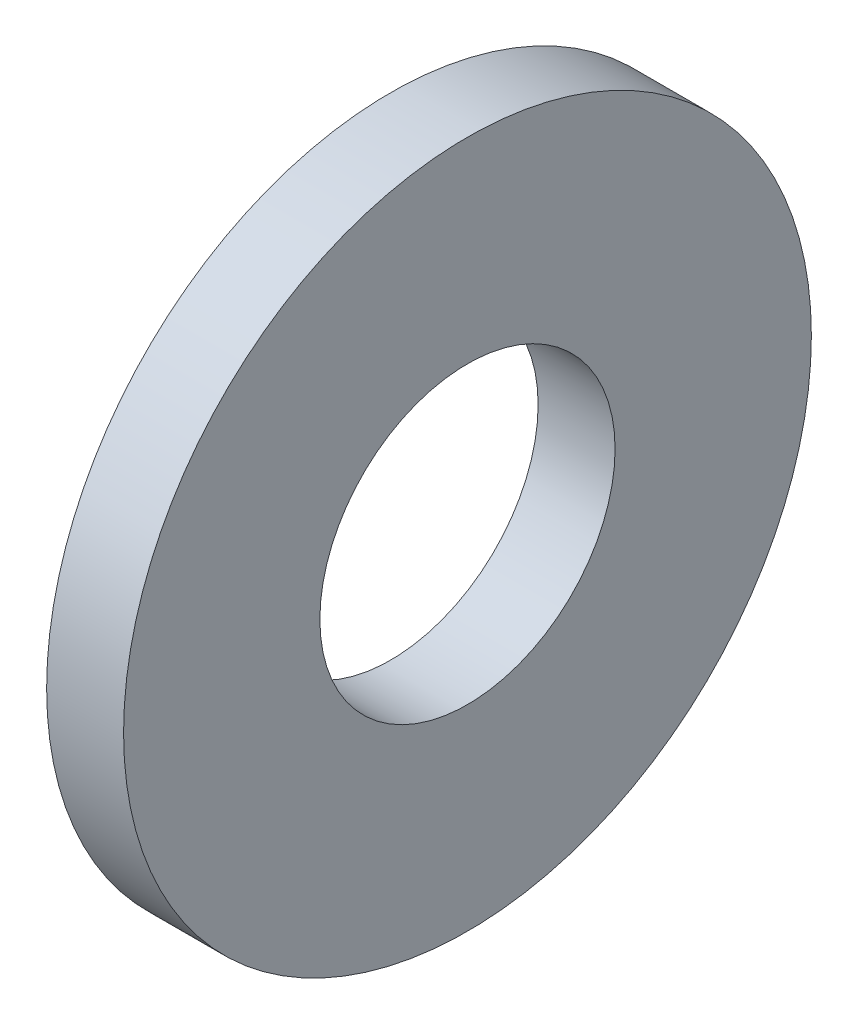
from build123d import *

# Parameters (mm, degrees)
SKETCH1_W = 1.2446
SKETCH1_H = 3.175


with BuildPart() as part:
    # Sketch1 → Base-Revolve (revolve)
    with BuildSketch(Plane.XY, mode=Mode.PRIVATE) as base_revolve_sk:
        with Locations((-0.6223, 3.9751)):
            Rectangle(SKETCH1_W, SKETCH1_H)
    revolve(base_revolve_sk.sketch.rotate(Axis((-34.925, 0, 0), (1, 0, 0)), 90), axis=Axis((-34.925, 0, 0), (1, 0, 0)))


solid = part.part
